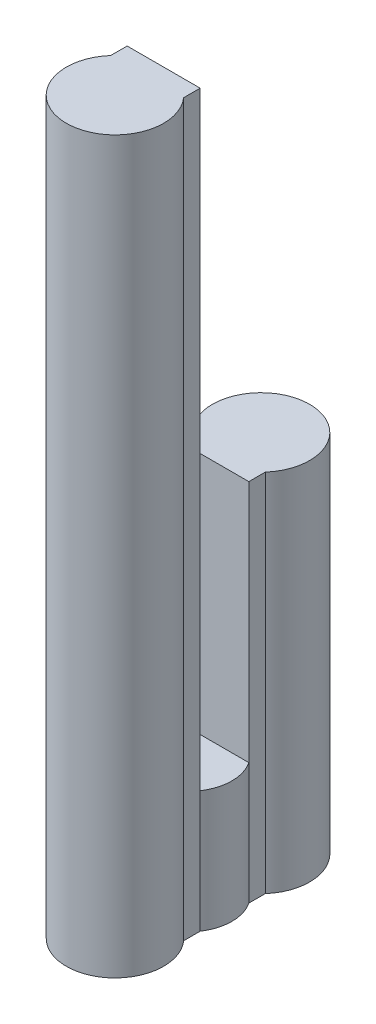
ISO-10303-21;
HEADER;
FILE_DESCRIPTION(('STEP AP214'),'2;1');
FILE_NAME('part.step','',(''),(''),'','','');
FILE_SCHEMA(('AUTOMOTIVE_DESIGN { 1 0 10303 214 1 1 1 1 }'));
ENDSEC;
DATA;
#1=APPLICATION_CONTEXT('core data for automotive mechanical design processes');
#2=APPLICATION_PROTOCOL_DEFINITION('international standard','automotive_design',2000,#1);
#3=PRODUCT_CONTEXT('',#1,'mechanical');
#4=PRODUCT('Part','Part','',(#3));
#5=PRODUCT_RELATED_PRODUCT_CATEGORY('part','',(#4));
#6=PRODUCT_DEFINITION_FORMATION('','',#4);
#7=PRODUCT_DEFINITION_CONTEXT('part definition',#1,'design');
#8=PRODUCT_DEFINITION('design','',#6,#7);
#9=PRODUCT_DEFINITION_SHAPE('','',#8);
#10=(LENGTH_UNIT() NAMED_UNIT(*) SI_UNIT(.MILLI.,.METRE.));
#11=(NAMED_UNIT(*) PLANE_ANGLE_UNIT() SI_UNIT($,.RADIAN.));
#12=(NAMED_UNIT(*) SI_UNIT($,.STERADIAN.) SOLID_ANGLE_UNIT());
#13=UNCERTAINTY_MEASURE_WITH_UNIT(LENGTH_MEASURE(1.E-05),#10,'distance_accuracy_value','');
#14=(GEOMETRIC_REPRESENTATION_CONTEXT(3) GLOBAL_UNCERTAINTY_ASSIGNED_CONTEXT((#13)) GLOBAL_UNIT_ASSIGNED_CONTEXT((#10,
#11,#12)) REPRESENTATION_CONTEXT('',''));
#15=CARTESIAN_POINT('',(0.,0.,0.));
#16=DIRECTION('',(0.,0.,1.));
#17=DIRECTION('',(1.,0.,0.));
#18=AXIS2_PLACEMENT_3D('',#15,#16,#17);
#19=CARTESIAN_POINT('',(0.,5.,1.));
#20=DIRECTION('',(0.,-1.,0.));
#21=DIRECTION('',(0.,0.,-1.));
#22=AXIS2_PLACEMENT_3D('',#19,#20,#21);
#23=CYLINDRICAL_SURFACE('',#22,1.80277563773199);
#24=DIRECTION('',(0.,-1.,0.));
#25=VECTOR('',#24,1.);
#26=CARTESIAN_POINT('',(1.5,5.,2.));
#27=LINE('',#26,#25);
#28=CARTESIAN_POINT('',(1.5,0.,2.));
#29=VERTEX_POINT('',#28);
#30=CARTESIAN_POINT('',(1.5,5.,2.));
#31=VERTEX_POINT('',#30);
#32=EDGE_CURVE('E11',#29,#31,#27,.F.);
#33=ORIENTED_EDGE('',*,*,#32,.F.);
#34=CARTESIAN_POINT('',(0.,0.,1.));
#35=DIRECTION('',(0.,-1.,0.));
#36=DIRECTION('',(0.,0.,-1.));
#37=AXIS2_PLACEMENT_3D('',#34,#35,#36);
#38=CIRCLE('',#37,1.80277563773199);
#39=CARTESIAN_POINT('',(1.5,0.,0.));
#40=VERTEX_POINT('',#39);
#41=EDGE_CURVE('E167',#40,#29,#38,.T.);
#42=ORIENTED_EDGE('',*,*,#41,.F.);
#43=DIRECTION('',(0.,-1.,0.));
#44=VECTOR('',#43,1.);
#45=CARTESIAN_POINT('',(1.5,5.,0.));
#46=LINE('',#45,#44);
#47=CARTESIAN_POINT('',(1.5,5.,0.));
#48=VERTEX_POINT('',#47);
#49=EDGE_CURVE('E165',#48,#40,#46,.T.);
#50=ORIENTED_EDGE('',*,*,#49,.F.);
#51=CARTESIAN_POINT('',(0.,5.,1.));
#52=DIRECTION('',(0.,-1.,0.));
#53=DIRECTION('',(0.,0.,-1.));
#54=AXIS2_PLACEMENT_3D('',#51,#52,#53);
#55=CIRCLE('',#54,1.80277563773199);
#56=EDGE_CURVE('E162',#48,#31,#55,.T.);
#57=ORIENTED_EDGE('',*,*,#56,.T.);
#58=EDGE_LOOP('',(#33,#42,#50,#57));
#59=FACE_BOUND('',#58,.T.);
#60=ADVANCED_FACE('F34',(#59),#23,.T.);
#61=CARTESIAN_POINT('',(-1.5,15.,0.));
#62=DIRECTION('',(0.,0.,-1.));
#63=DIRECTION('',(-1.,0.,0.));
#64=AXIS2_PLACEMENT_3D('',#61,#62,#63);
#65=PLANE('',#64);
#66=DIRECTION('',(-1.,0.,0.));
#67=VECTOR('',#66,1.);
#68=CARTESIAN_POINT('',(-1.5,5.,0.));
#69=LINE('',#68,#67);
#70=CARTESIAN_POINT('',(-1.5,5.,0.));
#71=VERTEX_POINT('',#70);
#72=EDGE_CURVE('E175',#48,#71,#69,.T.);
#73=ORIENTED_EDGE('',*,*,#72,.F.);
#74=DIRECTION('',(0.,-1.,0.));
#75=VECTOR('',#74,1.);
#76=CARTESIAN_POINT('',(1.5,15.,0.));
#77=LINE('',#76,#75);
#78=CARTESIAN_POINT('',(1.5,15.,0.));
#79=VERTEX_POINT('',#78);
#80=EDGE_CURVE('E194',#79,#48,#77,.T.);
#81=ORIENTED_EDGE('',*,*,#80,.F.);
#82=DIRECTION('',(1.,0.,0.));
#83=VECTOR('',#82,1.);
#84=CARTESIAN_POINT('',(-1.5,15.,0.));
#85=LINE('',#84,#83);
#86=CARTESIAN_POINT('',(-1.5,15.,0.));
#87=VERTEX_POINT('',#86);
#88=EDGE_CURVE('E84',#87,#79,#85,.T.);
#89=ORIENTED_EDGE('',*,*,#88,.F.);
#90=DIRECTION('',(0.,-1.,0.));
#91=VECTOR('',#90,1.);
#92=CARTESIAN_POINT('',(-1.5,15.,0.));
#93=LINE('',#92,#91);
#94=EDGE_CURVE('E197',#87,#71,#93,.T.);
#95=ORIENTED_EDGE('',*,*,#94,.T.);
#96=EDGE_LOOP('',(#73,#81,#89,#95));
#97=FACE_BOUND('',#96,.T.);
#98=ADVANCED_FACE('F225',(#97),#65,.F.);
#99=CARTESIAN_POINT('',(-1.5,15.,0.));
#100=DIRECTION('',(1.,0.,0.));
#101=DIRECTION('',(0.,0.,-1.));
#102=AXIS2_PLACEMENT_3D('',#99,#100,#101);
#103=PLANE('',#102);
#104=DIRECTION('',(0.,0.,1.));
#105=VECTOR('',#104,1.);
#106=CARTESIAN_POINT('',(-1.5,0.,0.));
#107=LINE('',#106,#105);
#108=CARTESIAN_POINT('',(-1.5,0.,-0.677124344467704));
#109=VERTEX_POINT('',#108);
#110=CARTESIAN_POINT('',(-1.5,0.,0.));
#111=VERTEX_POINT('',#110);
#112=EDGE_CURVE('E178',#109,#111,#107,.T.);
#113=ORIENTED_EDGE('',*,*,#112,.T.);
#114=DIRECTION('',(0.,-1.,0.));
#115=VECTOR('',#114,1.);
#116=CARTESIAN_POINT('',(-1.5,5.,0.));
#117=LINE('',#116,#115);
#118=EDGE_CURVE('E172',#111,#71,#117,.F.);
#119=ORIENTED_EDGE('',*,*,#118,.T.);
#120=ORIENTED_EDGE('',*,*,#94,.F.);
#121=DIRECTION('',(0.,0.,1.));
#122=VECTOR('',#121,1.);
#123=CARTESIAN_POINT('',(-1.5,15.,0.));
#124=LINE('',#123,#122);
#125=CARTESIAN_POINT('',(-1.5,15.,-0.677124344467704));
#126=VERTEX_POINT('',#125);
#127=EDGE_CURVE('E179',#126,#87,#124,.T.);
#128=ORIENTED_EDGE('',*,*,#127,.F.);
#129=DIRECTION('',(0.,-1.,0.));
#130=VECTOR('',#129,1.);
#131=CARTESIAN_POINT('',(-1.5,15.,-0.677124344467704));
#132=LINE('',#131,#130);
#133=EDGE_CURVE('E185',#126,#109,#132,.T.);
#134=ORIENTED_EDGE('',*,*,#133,.T.);
#135=EDGE_LOOP('',(#113,#119,#120,#128,#134));
#136=FACE_BOUND('',#135,.T.);
#137=ADVANCED_FACE('F36',(#136),#103,.F.);
#138=CARTESIAN_POINT('',(1.5,15.,0.));
#139=DIRECTION('',(-1.,0.,0.));
#140=DIRECTION('',(0.,0.,1.));
#141=AXIS2_PLACEMENT_3D('',#138,#139,#140);
#142=PLANE('',#141);
#143=DIRECTION('',(0.,0.,-1.));
#144=VECTOR('',#143,1.);
#145=CARTESIAN_POINT('',(1.5,0.,0.));
#146=LINE('',#145,#144);
#147=CARTESIAN_POINT('',(1.5,0.,-0.677124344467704));
#148=VERTEX_POINT('',#147);
#149=EDGE_CURVE('E188',#40,#148,#146,.T.);
#150=ORIENTED_EDGE('',*,*,#149,.T.);
#151=DIRECTION('',(0.,-1.,0.));
#152=VECTOR('',#151,1.);
#153=CARTESIAN_POINT('',(1.5,15.,-0.677124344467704));
#154=LINE('',#153,#152);
#155=CARTESIAN_POINT('',(1.5,15.,-0.677124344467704));
#156=VERTEX_POINT('',#155);
#157=EDGE_CURVE('E192',#156,#148,#154,.T.);
#158=ORIENTED_EDGE('',*,*,#157,.F.);
#159=DIRECTION('',(0.,0.,-1.));
#160=VECTOR('',#159,1.);
#161=CARTESIAN_POINT('',(1.5,15.,0.));
#162=LINE('',#161,#160);
#163=EDGE_CURVE('E182',#79,#156,#162,.T.);
#164=ORIENTED_EDGE('',*,*,#163,.F.);
#165=ORIENTED_EDGE('',*,*,#80,.T.);
#166=ORIENTED_EDGE('',*,*,#49,.T.);
#167=EDGE_LOOP('',(#150,#158,#164,#165,#166));
#168=FACE_BOUND('',#167,.T.);
#169=ADVANCED_FACE('F216',(#168),#142,.F.);
#170=CARTESIAN_POINT('',(0.,15.,-2.));
#171=DIRECTION('',(0.,-1.,0.));
#172=DIRECTION('',(0.,0.,-1.));
#173=AXIS2_PLACEMENT_3D('',#170,#171,#172);
#174=CYLINDRICAL_SURFACE('',#173,2.);
#175=CARTESIAN_POINT('',(0.,0.,-2.));
#176=DIRECTION('',(0.,1.,0.));
#177=DIRECTION('',(0.,0.,1.));
#178=AXIS2_PLACEMENT_3D('',#175,#176,#177);
#179=CIRCLE('',#178,2.);
#180=EDGE_CURVE('E76',#148,#109,#179,.T.);
#181=ORIENTED_EDGE('',*,*,#180,.T.);
#182=ORIENTED_EDGE('',*,*,#133,.F.);
#183=CARTESIAN_POINT('',(0.,15.,-2.));
#184=DIRECTION('',(0.,1.,0.));
#185=DIRECTION('',(0.,0.,1.));
#186=AXIS2_PLACEMENT_3D('',#183,#184,#185);
#187=CIRCLE('',#186,2.);
#188=EDGE_CURVE('E58',#156,#126,#187,.T.);
#189=ORIENTED_EDGE('',*,*,#188,.F.);
#190=ORIENTED_EDGE('',*,*,#157,.T.);
#191=EDGE_LOOP('',(#181,#182,#189,#190));
#192=FACE_BOUND('',#191,.T.);
#193=ADVANCED_FACE('F212',(#192),#174,.T.);
#194=CARTESIAN_POINT('',(0.,15.,-2.));
#195=DIRECTION('',(0.,1.,0.));
#196=DIRECTION('',(0.,0.,1.));
#197=AXIS2_PLACEMENT_3D('',#194,#195,#196);
#198=PLANE('',#197);
#199=ORIENTED_EDGE('',*,*,#127,.T.);
#200=ORIENTED_EDGE('',*,*,#88,.T.);
#201=ORIENTED_EDGE('',*,*,#163,.T.);
#202=ORIENTED_EDGE('',*,*,#188,.T.);
#203=EDGE_LOOP('',(#199,#200,#201,#202));
#204=FACE_BOUND('',#203,.T.);
#205=ADVANCED_FACE('F237',(#204),#198,.T.);
#206=CARTESIAN_POINT('',(0.,0.,-2.));
#207=DIRECTION('',(0.,1.,0.));
#208=DIRECTION('',(0.,0.,1.));
#209=AXIS2_PLACEMENT_3D('',#206,#207,#208);
#210=PLANE('',#209);
#211=ORIENTED_EDGE('',*,*,#41,.T.);
#212=DIRECTION('',(0.,0.,1.));
#213=VECTOR('',#212,1.);
#214=CARTESIAN_POINT('',(1.5,0.,2.));
#215=LINE('',#214,#213);
#216=CARTESIAN_POINT('',(1.5,0.,2.6771243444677));
#217=VERTEX_POINT('',#216);
#218=EDGE_CURVE('E150',#29,#217,#215,.T.);
#219=ORIENTED_EDGE('',*,*,#218,.T.);
#220=CARTESIAN_POINT('',(0.,0.,4.));
#221=DIRECTION('',(0.,-1.,0.));
#222=DIRECTION('',(0.,0.,-1.));
#223=AXIS2_PLACEMENT_3D('',#220,#221,#222);
#224=CIRCLE('',#223,2.);
#225=CARTESIAN_POINT('',(-1.5,0.,2.6771243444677));
#226=VERTEX_POINT('',#225);
#227=EDGE_CURVE('E125',#217,#226,#224,.T.);
#228=ORIENTED_EDGE('',*,*,#227,.T.);
#229=DIRECTION('',(0.,0.,-1.));
#230=VECTOR('',#229,1.);
#231=CARTESIAN_POINT('',(-1.5,0.,2.));
#232=LINE('',#231,#230);
#233=CARTESIAN_POINT('',(-1.5,0.,2.));
#234=VERTEX_POINT('',#233);
#235=EDGE_CURVE('E49',#226,#234,#232,.T.);
#236=ORIENTED_EDGE('',*,*,#235,.T.);
#237=EDGE_CURVE('E161',#234,#111,#38,.T.);
#238=ORIENTED_EDGE('',*,*,#237,.T.);
#239=ORIENTED_EDGE('',*,*,#112,.F.);
#240=ORIENTED_EDGE('',*,*,#180,.F.);
#241=ORIENTED_EDGE('',*,*,#149,.F.);
#242=EDGE_LOOP('',(#211,#219,#228,#236,#238,#239,#240,#241));
#243=FACE_BOUND('',#242,.T.);
#244=ADVANCED_FACE('F207',(#243),#210,.F.);
#245=CARTESIAN_POINT('',(0.,5.,1.));
#246=DIRECTION('',(0.,-1.,0.));
#247=DIRECTION('',(0.,0.,-1.));
#248=AXIS2_PLACEMENT_3D('',#245,#246,#247);
#249=PLANE('',#248);
#250=CARTESIAN_POINT('',(-1.5,5.,2.));
#251=VERTEX_POINT('',#250);
#252=EDGE_CURVE('E166',#251,#71,#55,.T.);
#253=ORIENTED_EDGE('',*,*,#252,.F.);
#254=DIRECTION('',(1.,0.,0.));
#255=VECTOR('',#254,1.);
#256=CARTESIAN_POINT('',(0.,5.,2.));
#257=LINE('',#256,#255);
#258=EDGE_CURVE('E154',#251,#31,#257,.T.);
#259=ORIENTED_EDGE('',*,*,#258,.T.);
#260=ORIENTED_EDGE('',*,*,#56,.F.);
#261=ORIENTED_EDGE('',*,*,#72,.T.);
#262=EDGE_LOOP('',(#253,#259,#260,#261));
#263=FACE_BOUND('',#262,.T.);
#264=ADVANCED_FACE('F223',(#263),#249,.F.);
#265=DIRECTION('',(0.,-1.,0.));
#266=VECTOR('',#265,1.);
#267=CARTESIAN_POINT('',(-1.5,5.,2.));
#268=LINE('',#267,#266);
#269=EDGE_CURVE('E42',#251,#234,#268,.T.);
#270=ORIENTED_EDGE('',*,*,#269,.F.);
#271=ORIENTED_EDGE('',*,*,#252,.T.);
#272=ORIENTED_EDGE('',*,*,#118,.F.);
#273=ORIENTED_EDGE('',*,*,#237,.F.);
#274=EDGE_LOOP('',(#270,#271,#272,#273));
#275=FACE_BOUND('',#274,.T.);
#276=ADVANCED_FACE('F205',(#275),#23,.T.);
#277=CARTESIAN_POINT('',(1.5,30.,2.));
#278=DIRECTION('',(0.,0.,-1.));
#279=DIRECTION('',(-1.,0.,0.));
#280=AXIS2_PLACEMENT_3D('',#277,#278,#279);
#281=PLANE('',#280);
#282=ORIENTED_EDGE('',*,*,#258,.F.);
#283=DIRECTION('',(0.,-1.,0.));
#284=VECTOR('',#283,1.);
#285=CARTESIAN_POINT('',(-1.5,30.,2.));
#286=LINE('',#285,#284);
#287=CARTESIAN_POINT('',(-1.5,30.,2.));
#288=VERTEX_POINT('',#287);
#289=EDGE_CURVE('E155',#288,#251,#286,.T.);
#290=ORIENTED_EDGE('',*,*,#289,.F.);
#291=DIRECTION('',(1.,0.,0.));
#292=VECTOR('',#291,1.);
#293=CARTESIAN_POINT('',(1.5,30.,2.));
#294=LINE('',#293,#292);
#295=CARTESIAN_POINT('',(1.5,30.,2.));
#296=VERTEX_POINT('',#295);
#297=EDGE_CURVE('E130',#288,#296,#294,.T.);
#298=ORIENTED_EDGE('',*,*,#297,.T.);
#299=DIRECTION('',(0.,-1.,0.));
#300=VECTOR('',#299,1.);
#301=CARTESIAN_POINT('',(1.5,30.,2.));
#302=LINE('',#301,#300);
#303=EDGE_CURVE('E144',#296,#31,#302,.T.);
#304=ORIENTED_EDGE('',*,*,#303,.T.);
#305=EDGE_LOOP('',(#282,#290,#298,#304));
#306=FACE_BOUND('',#305,.T.);
#307=ADVANCED_FACE('F221',(#306),#281,.T.);
#308=CARTESIAN_POINT('',(1.5,30.,2.));
#309=DIRECTION('',(1.,0.,0.));
#310=DIRECTION('',(0.,0.,-1.));
#311=AXIS2_PLACEMENT_3D('',#308,#309,#310);
#312=PLANE('',#311);
#313=ORIENTED_EDGE('',*,*,#218,.F.);
#314=ORIENTED_EDGE('',*,*,#32,.T.);
#315=ORIENTED_EDGE('',*,*,#303,.F.);
#316=DIRECTION('',(0.,0.,1.));
#317=VECTOR('',#316,1.);
#318=CARTESIAN_POINT('',(1.5,30.,2.));
#319=LINE('',#318,#317);
#320=CARTESIAN_POINT('',(1.5,30.,2.6771243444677));
#321=VERTEX_POINT('',#320);
#322=EDGE_CURVE('E137',#296,#321,#319,.T.);
#323=ORIENTED_EDGE('',*,*,#322,.T.);
#324=DIRECTION('',(0.,-1.,0.));
#325=VECTOR('',#324,1.);
#326=CARTESIAN_POINT('',(1.5,30.,2.6771243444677));
#327=LINE('',#326,#325);
#328=EDGE_CURVE('E121',#321,#217,#327,.T.);
#329=ORIENTED_EDGE('',*,*,#328,.T.);
#330=EDGE_LOOP('',(#313,#314,#315,#323,#329));
#331=FACE_BOUND('',#330,.T.);
#332=ADVANCED_FACE('F142',(#331),#312,.T.);
#333=CARTESIAN_POINT('',(-1.5,30.,2.));
#334=DIRECTION('',(-1.,0.,0.));
#335=DIRECTION('',(0.,0.,1.));
#336=AXIS2_PLACEMENT_3D('',#333,#334,#335);
#337=PLANE('',#336);
#338=ORIENTED_EDGE('',*,*,#235,.F.);
#339=DIRECTION('',(0.,-1.,0.));
#340=VECTOR('',#339,1.);
#341=CARTESIAN_POINT('',(-1.5,30.,2.6771243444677));
#342=LINE('',#341,#340);
#343=CARTESIAN_POINT('',(-1.5,30.,2.6771243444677));
#344=VERTEX_POINT('',#343);
#345=EDGE_CURVE('E129',#344,#226,#342,.T.);
#346=ORIENTED_EDGE('',*,*,#345,.F.);
#347=DIRECTION('',(0.,0.,-1.));
#348=VECTOR('',#347,1.);
#349=CARTESIAN_POINT('',(-1.5,30.,2.));
#350=LINE('',#349,#348);
#351=EDGE_CURVE('E140',#344,#288,#350,.T.);
#352=ORIENTED_EDGE('',*,*,#351,.T.);
#353=ORIENTED_EDGE('',*,*,#289,.T.);
#354=ORIENTED_EDGE('',*,*,#269,.T.);
#355=EDGE_LOOP('',(#338,#346,#352,#353,#354));
#356=FACE_BOUND('',#355,.T.);
#357=ADVANCED_FACE('F201',(#356),#337,.T.);
#358=CARTESIAN_POINT('',(0.,30.,4.));
#359=DIRECTION('',(0.,-1.,0.));
#360=DIRECTION('',(0.,0.,-1.));
#361=AXIS2_PLACEMENT_3D('',#358,#359,#360);
#362=CYLINDRICAL_SURFACE('',#361,2.);
#363=ORIENTED_EDGE('',*,*,#227,.F.);
#364=ORIENTED_EDGE('',*,*,#328,.F.);
#365=CARTESIAN_POINT('',(0.,30.,4.));
#366=DIRECTION('',(0.,-1.,0.));
#367=DIRECTION('',(0.,0.,-1.));
#368=AXIS2_PLACEMENT_3D('',#365,#366,#367);
#369=CIRCLE('',#368,2.);
#370=EDGE_CURVE('E124',#321,#344,#369,.T.);
#371=ORIENTED_EDGE('',*,*,#370,.T.);
#372=ORIENTED_EDGE('',*,*,#345,.T.);
#373=EDGE_LOOP('',(#363,#364,#371,#372));
#374=FACE_BOUND('',#373,.T.);
#375=ADVANCED_FACE('F123',(#374),#362,.T.);
#376=CARTESIAN_POINT('',(0.,30.,4.));
#377=DIRECTION('',(0.,-1.,0.));
#378=DIRECTION('',(0.,0.,-1.));
#379=AXIS2_PLACEMENT_3D('',#376,#377,#378);
#380=PLANE('',#379);
#381=ORIENTED_EDGE('',*,*,#322,.F.);
#382=ORIENTED_EDGE('',*,*,#297,.F.);
#383=ORIENTED_EDGE('',*,*,#351,.F.);
#384=ORIENTED_EDGE('',*,*,#370,.F.);
#385=EDGE_LOOP('',(#381,#382,#383,#384));
#386=FACE_BOUND('',#385,.T.);
#387=ADVANCED_FACE('F135',(#386),#380,.F.);
#388=CLOSED_SHELL('',(#60,#98,#137,#169,#193,#205,#244,#264,#276,#307,#332,#357,#375,#387));
#389=MANIFOLD_SOLID_BREP('B2',#388);
#390=ADVANCED_BREP_SHAPE_REPRESENTATION('',(#18,#389),#14);
#391=SHAPE_DEFINITION_REPRESENTATION(#9,#390);
ENDSEC;
END-ISO-10303-21;
